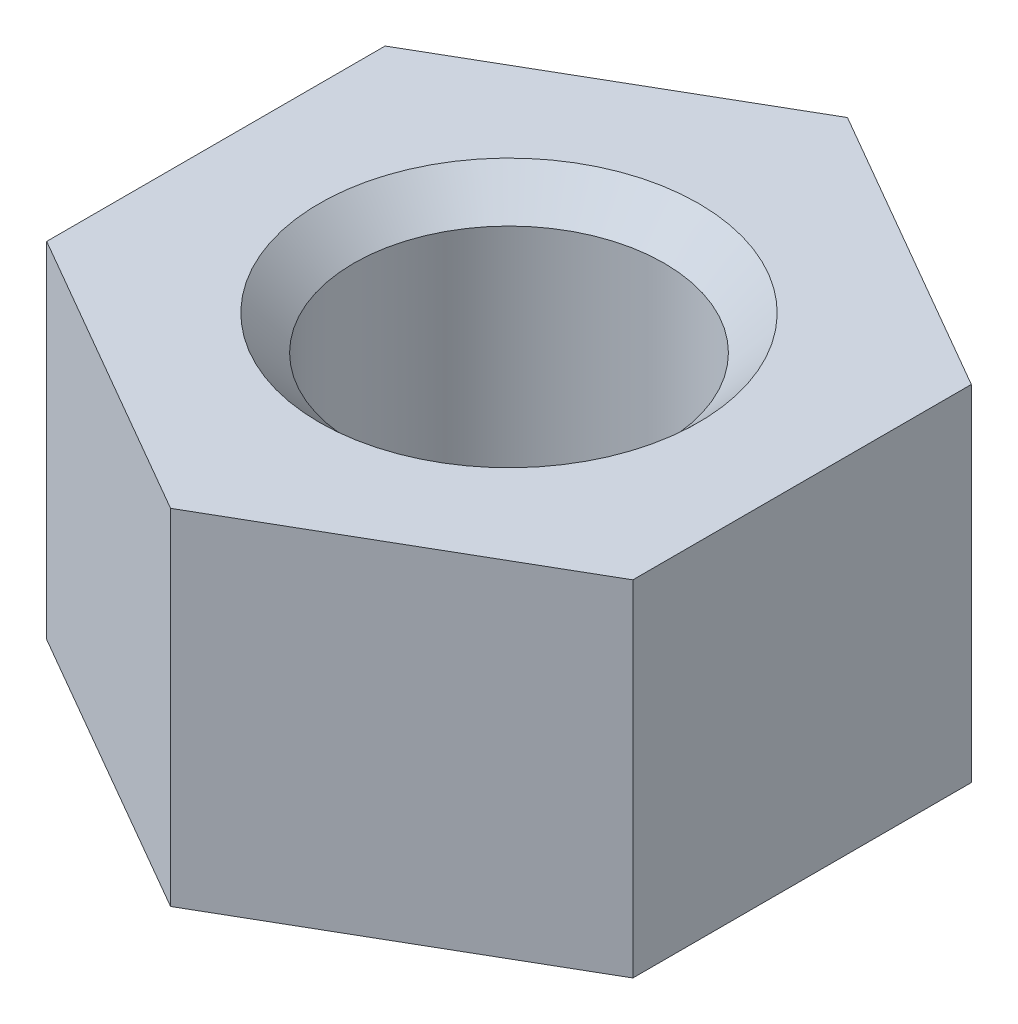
from build123d import *

# Parameters (mm, degrees)
SKETCH1_R           = 4.5
BOSS_EXTRUDE1_DEPTH = 10
CHAMFER1_SIZE       = 1


with BuildPart() as part:
    # Sketch1 → Boss-Extrude1 (new body)
    with BuildSketch(Plane(origin=(0, 0, 0), x_dir=(1, 0, 0), z_dir=(0, 1, 0))):
        Polygon((0, 9.814954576), (-8.5, 4.907477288), (-8.5, -4.907477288), (0, -9.814954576), (8.5, -4.907477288), (8.5, 4.907477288), align=None)
        with Locations(Location((0, 0, 0), (0, 0, 270))):
            Circle(SKETCH1_R, mode=Mode.SUBTRACT)
    extrude(amount=BOSS_EXTRUDE1_DEPTH)

    # Chamfer1
    chamfer1_edges = [part.edges().sort_by_distance(p)[0] for p in [
        (0, 0, -4.5),
        (0, 10, -4.5),
    ]]
    chamfer(chamfer1_edges, length=CHAMFER1_SIZE)


solid = part.part
